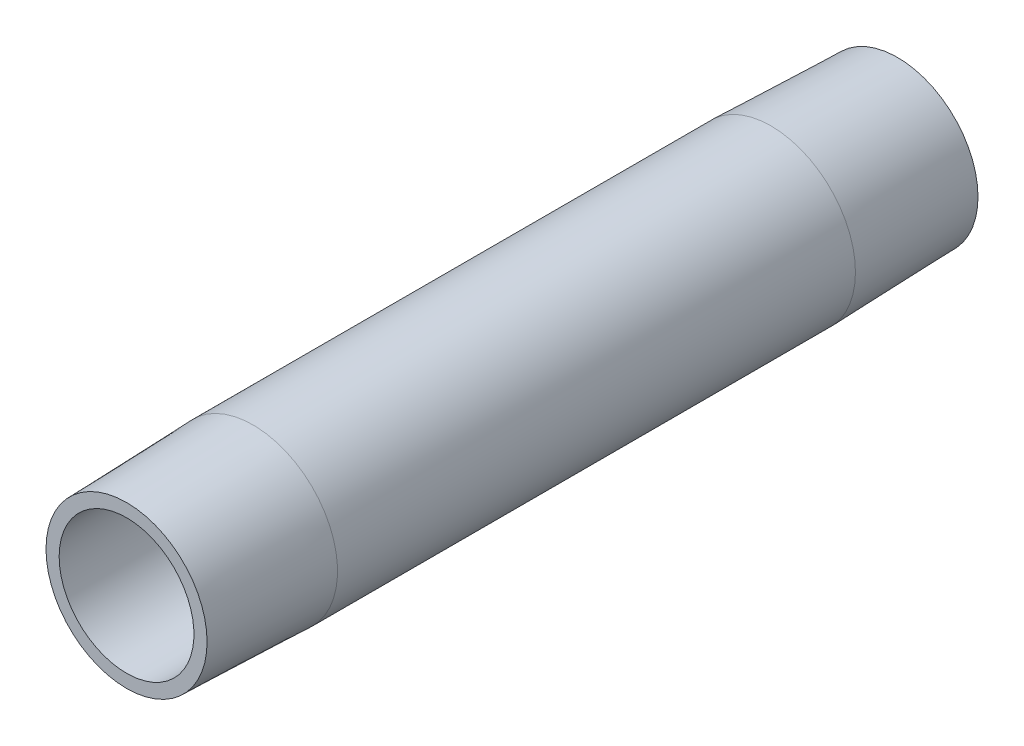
ISO-10303-21;
HEADER;
FILE_DESCRIPTION(('STEP AP214'),'2;1');
FILE_NAME('part.step','',(''),(''),'','','');
FILE_SCHEMA(('AUTOMOTIVE_DESIGN { 1 0 10303 214 1 1 1 1 }'));
ENDSEC;
DATA;
#1=APPLICATION_CONTEXT('core data for automotive mechanical design processes');
#2=APPLICATION_PROTOCOL_DEFINITION('international standard','automotive_design',2000,#1);
#3=PRODUCT_CONTEXT('',#1,'mechanical');
#4=PRODUCT('Part','Part','',(#3));
#5=PRODUCT_RELATED_PRODUCT_CATEGORY('part','',(#4));
#6=PRODUCT_DEFINITION_FORMATION('','',#4);
#7=PRODUCT_DEFINITION_CONTEXT('part definition',#1,'design');
#8=PRODUCT_DEFINITION('design','',#6,#7);
#9=PRODUCT_DEFINITION_SHAPE('','',#8);
#10=(LENGTH_UNIT() NAMED_UNIT(*) SI_UNIT(.MILLI.,.METRE.));
#11=(NAMED_UNIT(*) PLANE_ANGLE_UNIT() SI_UNIT($,.RADIAN.));
#12=(NAMED_UNIT(*) SI_UNIT($,.STERADIAN.) SOLID_ANGLE_UNIT());
#13=UNCERTAINTY_MEASURE_WITH_UNIT(LENGTH_MEASURE(1.E-05),#10,'distance_accuracy_value','');
#14=(GEOMETRIC_REPRESENTATION_CONTEXT(3) GLOBAL_UNCERTAINTY_ASSIGNED_CONTEXT((#13)) GLOBAL_UNIT_ASSIGNED_CONTEXT((#10,
#11,#12)) REPRESENTATION_CONTEXT('',''));
#15=CARTESIAN_POINT('',(0.,0.,0.));
#16=DIRECTION('',(0.,0.,1.));
#17=DIRECTION('',(1.,0.,0.));
#18=AXIS2_PLACEMENT_3D('',#15,#16,#17);
#19=CARTESIAN_POINT('',(0.,0.,0.));
#20=DIRECTION('',(0.,0.,1.));
#21=DIRECTION('',(1.,0.,0.));
#22=AXIS2_PLACEMENT_3D('',#19,#20,#21);
#23=PLANE('',#22);
#24=CARTESIAN_POINT('',(0.,0.,0.));
#25=DIRECTION('',(0.,0.,1.));
#26=DIRECTION('',(1.,0.,0.));
#27=AXIS2_PLACEMENT_3D('',#24,#25,#26);
#28=CIRCLE('',#27,13.3223);
#29=CARTESIAN_POINT('',(-13.3223,0.,0.));
#30=VERTEX_POINT('',#29);
#31=EDGE_CURVE('E36',#30,#30,#28,.T.);
#32=ORIENTED_EDGE('',*,*,#31,.T.);
#33=EDGE_LOOP('',(#32));
#34=FACE_BOUND('',#33,.T.);
#35=CARTESIAN_POINT('',(0.,0.,0.));
#36=DIRECTION('',(0.,0.,1.));
#37=DIRECTION('',(1.,0.,0.));
#38=AXIS2_PLACEMENT_3D('',#35,#36,#37);
#39=CIRCLE('',#38,15.9219265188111);
#40=CARTESIAN_POINT('',(15.9219265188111,0.,0.));
#41=VERTEX_POINT('',#40);
#42=EDGE_CURVE('E53',#41,#41,#39,.T.);
#43=ORIENTED_EDGE('',*,*,#42,.F.);
#44=EDGE_LOOP('',(#43));
#45=FACE_BOUND('',#44,.T.);
#46=ADVANCED_FACE('F32',(#34,#45),#23,.F.);
#47=CARTESIAN_POINT('',(0.,0.,152.4));
#48=DIRECTION('',(0.,0.,-1.));
#49=DIRECTION('',(-1.,0.,0.));
#50=AXIS2_PLACEMENT_3D('',#47,#48,#49);
#51=CYLINDRICAL_SURFACE('',#50,16.7005);
#52=CARTESIAN_POINT('',(0.,0.,127.3937));
#53=DIRECTION('',(0.,0.,1.));
#54=DIRECTION('',(1.,0.,0.));
#55=AXIS2_PLACEMENT_3D('',#52,#53,#54);
#56=CIRCLE('',#55,16.7005);
#57=CARTESIAN_POINT('',(-16.7005,0.,127.3937));
#58=VERTEX_POINT('',#57);
#59=EDGE_CURVE('E47',#58,#58,#56,.T.);
#60=CARTESIAN_POINT('',(0.,0.,25.0063));
#61=DIRECTION('',(0.,0.,1.));
#62=DIRECTION('',(1.,0.,0.));
#63=AXIS2_PLACEMENT_3D('',#60,#61,#62);
#64=CIRCLE('',#63,16.7005);
#65=CARTESIAN_POINT('',(-16.7005,0.,25.0063));
#66=VERTEX_POINT('',#65);
#67=EDGE_CURVE('E50',#66,#66,#64,.T.);
#68=CARTESIAN_POINT('',(-16.7005,0.,127.3937));
#69=CARTESIAN_POINT('',(-16.7005,0.,126.327164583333));
#70=CARTESIAN_POINT('',(-16.7005,0.,125.260629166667));
#71=CARTESIAN_POINT('',(-16.7005,0.,123.127558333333));
#72=CARTESIAN_POINT('',(-16.7005,0.,122.061022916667));
#73=CARTESIAN_POINT('',(-16.7005,0.,119.927952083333));
#74=CARTESIAN_POINT('',(-16.7005,0.,118.861416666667));
#75=CARTESIAN_POINT('',(-16.7005,0.,116.728345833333));
#76=CARTESIAN_POINT('',(-16.7005,0.,115.661810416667));
#77=CARTESIAN_POINT('',(-16.7005,0.,113.528739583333));
#78=CARTESIAN_POINT('',(-16.7005,0.,112.462204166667));
#79=CARTESIAN_POINT('',(-16.7005,0.,110.329133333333));
#80=CARTESIAN_POINT('',(-16.7005,0.,109.262597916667));
#81=CARTESIAN_POINT('',(-16.7005,0.,107.129527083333));
#82=CARTESIAN_POINT('',(-16.7005,0.,106.062991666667));
#83=CARTESIAN_POINT('',(-16.7005,0.,103.929920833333));
#84=CARTESIAN_POINT('',(-16.7005,0.,102.863385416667));
#85=CARTESIAN_POINT('',(-16.7005,0.,100.730314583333));
#86=CARTESIAN_POINT('',(-16.7005,0.,99.6637791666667));
#87=CARTESIAN_POINT('',(-16.7005,0.,97.5307083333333));
#88=CARTESIAN_POINT('',(-16.7005,0.,96.4641729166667));
#89=CARTESIAN_POINT('',(-16.7005,0.,94.3311020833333));
#90=CARTESIAN_POINT('',(-16.7005,0.,93.2645666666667));
#91=CARTESIAN_POINT('',(-16.7005,0.,91.1314958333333));
#92=CARTESIAN_POINT('',(-16.7005,0.,90.0649604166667));
#93=CARTESIAN_POINT('',(-16.7005,0.,87.9318895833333));
#94=CARTESIAN_POINT('',(-16.7005,0.,86.8653541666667));
#95=CARTESIAN_POINT('',(-16.7005,0.,84.7322833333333));
#96=CARTESIAN_POINT('',(-16.7005,0.,83.6657479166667));
#97=CARTESIAN_POINT('',(-16.7005,0.,81.5326770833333));
#98=CARTESIAN_POINT('',(-16.7005,0.,80.4661416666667));
#99=CARTESIAN_POINT('',(-16.7005,0.,78.3330708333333));
#100=CARTESIAN_POINT('',(-16.7005,0.,77.2665354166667));
#101=CARTESIAN_POINT('',(-16.7005,0.,75.1334645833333));
#102=CARTESIAN_POINT('',(-16.7005,0.,74.0669291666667));
#103=CARTESIAN_POINT('',(-16.7005,0.,71.9338583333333));
#104=CARTESIAN_POINT('',(-16.7005,0.,70.8673229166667));
#105=CARTESIAN_POINT('',(-16.7005,0.,68.7342520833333));
#106=CARTESIAN_POINT('',(-16.7005,0.,67.6677166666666));
#107=CARTESIAN_POINT('',(-16.7005,0.,65.5346458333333));
#108=CARTESIAN_POINT('',(-16.7005,0.,64.4681104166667));
#109=CARTESIAN_POINT('',(-16.7005,0.,62.3350395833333));
#110=CARTESIAN_POINT('',(-16.7005,0.,61.2685041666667));
#111=CARTESIAN_POINT('',(-16.7005,0.,59.1354333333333));
#112=CARTESIAN_POINT('',(-16.7005,0.,58.0688979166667));
#113=CARTESIAN_POINT('',(-16.7005,0.,55.9358270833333));
#114=CARTESIAN_POINT('',(-16.7005,0.,54.8692916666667));
#115=CARTESIAN_POINT('',(-16.7005,0.,52.7362208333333));
#116=CARTESIAN_POINT('',(-16.7005,0.,51.6696854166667));
#117=CARTESIAN_POINT('',(-16.7005,0.,49.5366145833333));
#118=CARTESIAN_POINT('',(-16.7005,0.,48.4700791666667));
#119=CARTESIAN_POINT('',(-16.7005,0.,46.3370083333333));
#120=CARTESIAN_POINT('',(-16.7005,0.,45.2704729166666));
#121=CARTESIAN_POINT('',(-16.7005,0.,43.1374020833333));
#122=CARTESIAN_POINT('',(-16.7005,0.,42.0708666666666));
#123=CARTESIAN_POINT('',(-16.7005,0.,39.9377958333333));
#124=CARTESIAN_POINT('',(-16.7005,0.,38.8712604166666));
#125=CARTESIAN_POINT('',(-16.7005,0.,36.7381895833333));
#126=CARTESIAN_POINT('',(-16.7005,0.,35.6716541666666));
#127=CARTESIAN_POINT('',(-16.7005,0.,33.5385833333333));
#128=CARTESIAN_POINT('',(-16.7005,0.,32.4720479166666));
#129=CARTESIAN_POINT('',(-16.7005,0.,30.3389770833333));
#130=CARTESIAN_POINT('',(-16.7005,0.,29.2724416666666));
#131=CARTESIAN_POINT('',(-16.7005,0.,27.1393708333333));
#132=CARTESIAN_POINT('',(-16.7005,0.,26.0728354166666));
#133=CARTESIAN_POINT('',(-16.7005,0.,25.0063));
#134=B_SPLINE_CURVE_WITH_KNOTS('',3,(#68,#69,#70,#71,#72,#73,#74,#75,#76,#77,#78,#79,#80,#81,
#82,#83,#84,#85,#86,#87,#88,#89,#90,#91,#92,#93,#94,#95,#96,#97,#98,#99,#100,#101,#102,#103,
#104,#105,#106,#107,#108,#109,#110,#111,#112,#113,#114,#115,#116,#117,#118,#119,#120,#121,#122,
#123,#124,#125,#126,#127,#128,#129,#130,#131,#132,#133),.UNSPECIFIED.,.F.,.F.,(4,2,2,2,2,2,2,2,
2,2,2,2,2,2,2,2,2,2,2,2,2,2,2,2,2,2,2,2,2,2,2,2,4),(0.,3.19960625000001,6.3992125,
9.59881875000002,12.798425,15.99803125,19.1976375,22.39724375,25.59685,28.79645625,31.9960625,
35.19566875,38.395275,41.59488125,44.7944875,47.99409375,51.1937,54.39330625,57.5929125,
60.79251875,63.992125,67.19173125,70.3913375,73.59094375,76.79055,79.99015625,83.1897625,
86.3893687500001,89.5889750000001,92.7885812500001,95.9881875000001,99.1877937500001,102.3874),.UNSPECIFIED.);
#135=EDGE_CURVE('BSEAM34',#58,#66,#134,.T.);
#136=ORIENTED_EDGE('',*,*,#59,.F.);
#137=ORIENTED_EDGE('',*,*,#67,.T.);
#138=ORIENTED_EDGE('',*,*,#135,.T.);
#139=ORIENTED_EDGE('',*,*,#135,.F.);
#140=EDGE_LOOP('',(#136,#138,#137,#139));
#141=FACE_BOUND('',#140,.T.);
#142=ADVANCED_FACE('F34',(#141),#51,.T.);
#143=CARTESIAN_POINT('',(0.,0.,152.4));
#144=DIRECTION('',(0.,0.,1.));
#145=DIRECTION('',(1.,0.,0.));
#146=AXIS2_PLACEMENT_3D('',#143,#144,#145);
#147=PLANE('',#146);
#148=CARTESIAN_POINT('',(0.,0.,152.4));
#149=DIRECTION('',(0.,0.,1.));
#150=DIRECTION('',(1.,0.,0.));
#151=AXIS2_PLACEMENT_3D('',#148,#149,#150);
#152=CIRCLE('',#151,15.9219265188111);
#153=CARTESIAN_POINT('',(15.9219265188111,0.,152.4));
#154=VERTEX_POINT('',#153);
#155=EDGE_CURVE('E43',#154,#154,#152,.T.);
#156=ORIENTED_EDGE('',*,*,#155,.T.);
#157=EDGE_LOOP('',(#156));
#158=FACE_BOUND('',#157,.T.);
#159=CARTESIAN_POINT('',(0.,0.,152.4));
#160=DIRECTION('',(0.,0.,1.));
#161=DIRECTION('',(1.,0.,0.));
#162=AXIS2_PLACEMENT_3D('',#159,#160,#161);
#163=CIRCLE('',#162,13.3223);
#164=CARTESIAN_POINT('',(-13.3223,0.,152.4));
#165=VERTEX_POINT('',#164);
#166=EDGE_CURVE('E10',#165,#165,#163,.T.);
#167=ORIENTED_EDGE('',*,*,#166,.F.);
#168=EDGE_LOOP('',(#167));
#169=FACE_BOUND('',#168,.T.);
#170=ADVANCED_FACE('F65',(#158,#169),#147,.T.);
#171=CARTESIAN_POINT('',(0.,0.,152.4));
#172=DIRECTION('',(0.,0.,-1.));
#173=DIRECTION('',(-1.,0.,0.));
#174=AXIS2_PLACEMENT_3D('',#171,#172,#173);
#175=CYLINDRICAL_SURFACE('',#174,13.3223);
#176=CARTESIAN_POINT('',(-13.3223,0.,152.4));
#177=CARTESIAN_POINT('',(-13.3223,0.,150.8125));
#178=CARTESIAN_POINT('',(-13.3223,0.,149.225));
#179=CARTESIAN_POINT('',(-13.3223,0.,146.05));
#180=CARTESIAN_POINT('',(-13.3223,0.,144.4625));
#181=CARTESIAN_POINT('',(-13.3223,0.,141.2875));
#182=CARTESIAN_POINT('',(-13.3223,0.,139.7));
#183=CARTESIAN_POINT('',(-13.3223,0.,136.525));
#184=CARTESIAN_POINT('',(-13.3223,0.,134.9375));
#185=CARTESIAN_POINT('',(-13.3223,0.,131.7625));
#186=CARTESIAN_POINT('',(-13.3223,0.,130.175));
#187=CARTESIAN_POINT('',(-13.3223,0.,127.));
#188=CARTESIAN_POINT('',(-13.3223,0.,125.4125));
#189=CARTESIAN_POINT('',(-13.3223,0.,122.2375));
#190=CARTESIAN_POINT('',(-13.3223,0.,120.65));
#191=CARTESIAN_POINT('',(-13.3223,0.,117.475));
#192=CARTESIAN_POINT('',(-13.3223,0.,115.8875));
#193=CARTESIAN_POINT('',(-13.3223,0.,112.7125));
#194=CARTESIAN_POINT('',(-13.3223,0.,111.125));
#195=CARTESIAN_POINT('',(-13.3223,0.,107.95));
#196=CARTESIAN_POINT('',(-13.3223,0.,106.3625));
#197=CARTESIAN_POINT('',(-13.3223,0.,103.1875));
#198=CARTESIAN_POINT('',(-13.3223,0.,101.6));
#199=CARTESIAN_POINT('',(-13.3223,0.,98.425));
#200=CARTESIAN_POINT('',(-13.3223,0.,96.8375));
#201=CARTESIAN_POINT('',(-13.3223,0.,93.6625));
#202=CARTESIAN_POINT('',(-13.3223,0.,92.075));
#203=CARTESIAN_POINT('',(-13.3223,0.,88.9));
#204=CARTESIAN_POINT('',(-13.3223,0.,87.3125));
#205=CARTESIAN_POINT('',(-13.3223,0.,84.1375));
#206=CARTESIAN_POINT('',(-13.3223,0.,82.55));
#207=CARTESIAN_POINT('',(-13.3223,0.,79.375));
#208=CARTESIAN_POINT('',(-13.3223,0.,77.7875));
#209=CARTESIAN_POINT('',(-13.3223,0.,74.6125));
#210=CARTESIAN_POINT('',(-13.3223,0.,73.025));
#211=CARTESIAN_POINT('',(-13.3223,0.,69.85));
#212=CARTESIAN_POINT('',(-13.3223,0.,68.2625));
#213=CARTESIAN_POINT('',(-13.3223,0.,65.0875));
#214=CARTESIAN_POINT('',(-13.3223,0.,63.5));
#215=CARTESIAN_POINT('',(-13.3223,0.,60.325));
#216=CARTESIAN_POINT('',(-13.3223,0.,58.7375));
#217=CARTESIAN_POINT('',(-13.3223,0.,55.5625));
#218=CARTESIAN_POINT('',(-13.3223,0.,53.975));
#219=CARTESIAN_POINT('',(-13.3223,0.,50.8));
#220=CARTESIAN_POINT('',(-13.3223,0.,49.2125));
#221=CARTESIAN_POINT('',(-13.3223,0.,46.0375));
#222=CARTESIAN_POINT('',(-13.3223,0.,44.45));
#223=CARTESIAN_POINT('',(-13.3223,0.,41.275));
#224=CARTESIAN_POINT('',(-13.3223,0.,39.6875));
#225=CARTESIAN_POINT('',(-13.3223,0.,36.5125));
#226=CARTESIAN_POINT('',(-13.3223,0.,34.925));
#227=CARTESIAN_POINT('',(-13.3223,0.,31.75));
#228=CARTESIAN_POINT('',(-13.3223,0.,30.1625));
#229=CARTESIAN_POINT('',(-13.3223,0.,26.9875));
#230=CARTESIAN_POINT('',(-13.3223,0.,25.4));
#231=CARTESIAN_POINT('',(-13.3223,0.,22.225));
#232=CARTESIAN_POINT('',(-13.3223,0.,20.6375));
#233=CARTESIAN_POINT('',(-13.3223,0.,17.4625));
#234=CARTESIAN_POINT('',(-13.3223,0.,15.875));
#235=CARTESIAN_POINT('',(-13.3223,0.,12.7));
#236=CARTESIAN_POINT('',(-13.3223,0.,11.1125));
#237=CARTESIAN_POINT('',(-13.3223,0.,7.93750000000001));
#238=CARTESIAN_POINT('',(-13.3223,0.,6.35));
#239=CARTESIAN_POINT('',(-13.3223,0.,3.175));
#240=CARTESIAN_POINT('',(-13.3223,0.,1.5875));
#241=CARTESIAN_POINT('',(-13.3223,0.,0.));
#242=B_SPLINE_CURVE_WITH_KNOTS('',3,(#176,#177,#178,#179,#180,#181,#182,#183,#184,#185,#186,
#187,#188,#189,#190,#191,#192,#193,#194,#195,#196,#197,#198,#199,#200,#201,#202,#203,#204,#205,
#206,#207,#208,#209,#210,#211,#212,#213,#214,#215,#216,#217,#218,#219,#220,#221,#222,#223,#224,
#225,#226,#227,#228,#229,#230,#231,#232,#233,#234,#235,#236,#237,#238,#239,#240,#241),
.UNSPECIFIED.,.F.,.F.,(4,2,2,2,2,2,2,2,2,2,2,2,2,2,2,2,2,2,2,2,2,2,2,2,2,2,2,2,2,2,2,2,4),(0.,
4.76249999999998,9.52499999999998,14.2875,19.05,23.8125,28.575,33.3375,38.1,42.8625,47.625,
52.3875,57.15,61.9125,66.675,71.4375,76.2,80.9625,85.725,90.4875,95.25,100.0125,104.775,
109.5375,114.3,119.0625,123.825,128.5875,133.35,138.1125,142.875,147.6375,152.4),.UNSPECIFIED.);
#243=EDGE_CURVE('BSEAM70',#165,#30,#242,.T.);
#244=ORIENTED_EDGE('',*,*,#166,.T.);
#245=ORIENTED_EDGE('',*,*,#31,.F.);
#246=ORIENTED_EDGE('',*,*,#243,.T.);
#247=ORIENTED_EDGE('',*,*,#243,.F.);
#248=EDGE_LOOP('',(#244,#246,#245,#247));
#249=FACE_BOUND('',#248,.T.);
#250=ADVANCED_FACE('F70',(#249),#175,.F.);
#251=CARTESIAN_POINT('',(0.,0.,127.3937));
#252=DIRECTION('',(0.,0.,-1.));
#253=DIRECTION('',(-1.,0.,0.));
#254=AXIS2_PLACEMENT_3D('',#251,#252,#253);
#255=CONICAL_SURFACE('',#254,16.7005,0.0311250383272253);
#256=ORIENTED_EDGE('',*,*,#155,.F.);
#257=EDGE_LOOP('',(#256));
#258=FACE_BOUND('',#257,.T.);
#259=ORIENTED_EDGE('',*,*,#59,.T.);
#260=EDGE_LOOP('',(#259));
#261=FACE_BOUND('',#260,.T.);
#262=ADVANCED_FACE('F74',(#258,#261),#255,.T.);
#263=CARTESIAN_POINT('',(0.,0.,25.0063));
#264=DIRECTION('',(0.,0.,1.));
#265=DIRECTION('',(1.,0.,0.));
#266=AXIS2_PLACEMENT_3D('',#263,#264,#265);
#267=CONICAL_SURFACE('',#266,16.7005,0.0311250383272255);
#268=ORIENTED_EDGE('',*,*,#42,.T.);
#269=EDGE_LOOP('',(#268));
#270=FACE_BOUND('',#269,.T.);
#271=ORIENTED_EDGE('',*,*,#67,.F.);
#272=EDGE_LOOP('',(#271));
#273=FACE_BOUND('',#272,.T.);
#274=ADVANCED_FACE('F57',(#270,#273),#267,.T.);
#275=CLOSED_SHELL('',(#46,#142,#170,#250,#262,#274));
#276=MANIFOLD_SOLID_BREP('B2',#275);
#277=ADVANCED_BREP_SHAPE_REPRESENTATION('',(#18,#276),#14);
#278=SHAPE_DEFINITION_REPRESENTATION(#9,#277);
ENDSEC;
END-ISO-10303-21;
